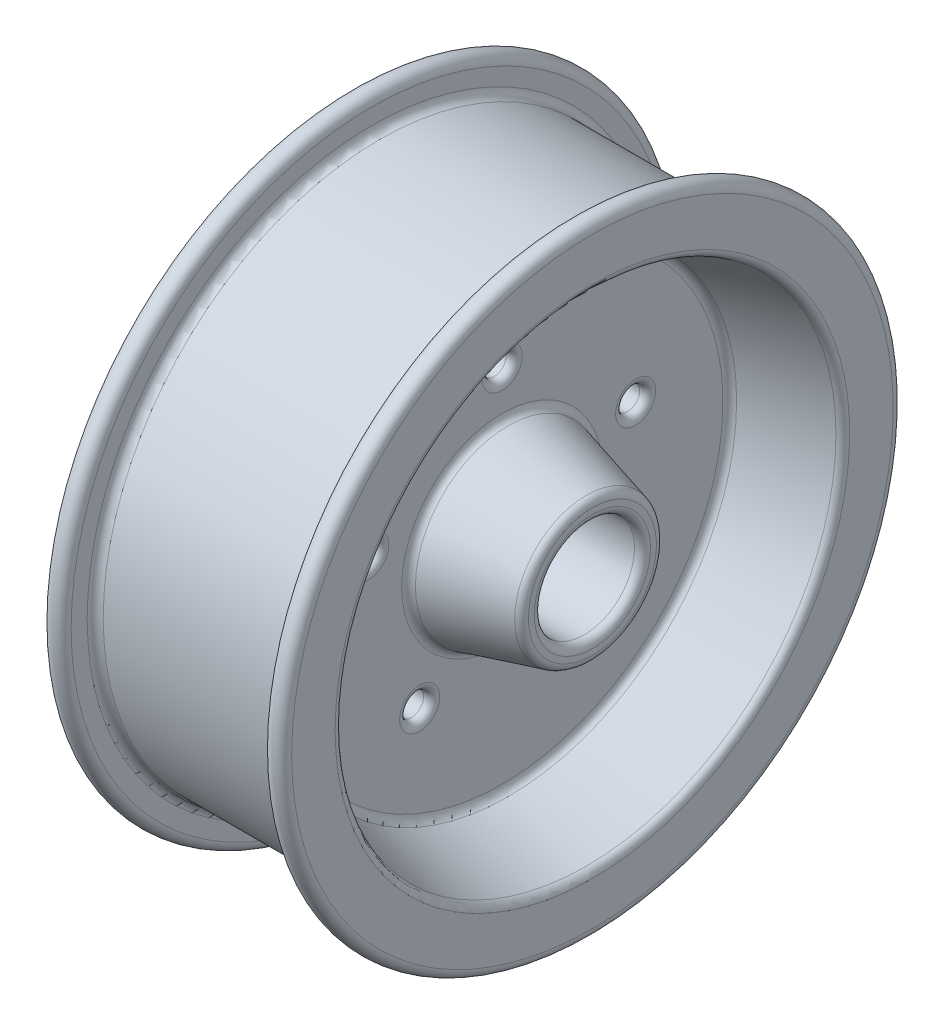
ISO-10303-21;
HEADER;
FILE_DESCRIPTION(('STEP AP214'),'2;1');
FILE_NAME('part.step','',(''),(''),'','','');
FILE_SCHEMA(('AUTOMOTIVE_DESIGN { 1 0 10303 214 1 1 1 1 }'));
ENDSEC;
DATA;
#1=APPLICATION_CONTEXT('core data for automotive mechanical design processes');
#2=APPLICATION_PROTOCOL_DEFINITION('international standard','automotive_design',2000,#1);
#3=PRODUCT_CONTEXT('',#1,'mechanical');
#4=PRODUCT('Part','Part','',(#3));
#5=PRODUCT_RELATED_PRODUCT_CATEGORY('part','',(#4));
#6=PRODUCT_DEFINITION_FORMATION('','',#4);
#7=PRODUCT_DEFINITION_CONTEXT('part definition',#1,'design');
#8=PRODUCT_DEFINITION('design','',#6,#7);
#9=PRODUCT_DEFINITION_SHAPE('','',#8);
#10=(LENGTH_UNIT() NAMED_UNIT(*) SI_UNIT(.MILLI.,.METRE.));
#11=(NAMED_UNIT(*) PLANE_ANGLE_UNIT() SI_UNIT($,.RADIAN.));
#12=(NAMED_UNIT(*) SI_UNIT($,.STERADIAN.) SOLID_ANGLE_UNIT());
#13=UNCERTAINTY_MEASURE_WITH_UNIT(LENGTH_MEASURE(1.E-05),#10,'distance_accuracy_value','');
#14=(GEOMETRIC_REPRESENTATION_CONTEXT(3) GLOBAL_UNCERTAINTY_ASSIGNED_CONTEXT((#13)) GLOBAL_UNIT_ASSIGNED_CONTEXT((#10,
#11,#12)) REPRESENTATION_CONTEXT('',''));
#15=CARTESIAN_POINT('',(0.,0.,0.));
#16=DIRECTION('',(0.,0.,1.));
#17=DIRECTION('',(1.,0.,0.));
#18=AXIS2_PLACEMENT_3D('',#15,#16,#17);
#19=CARTESIAN_POINT('',(-9.525,0.,0.));
#20=DIRECTION('',(1.,0.,0.));
#21=DIRECTION('',(0.,0.,-1.));
#22=AXIS2_PLACEMENT_3D('',#19,#20,#21);
#23=CONICAL_SURFACE('',#22,29.8816481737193,0.26179938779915);
#24=CARTESIAN_POINT('',(-11.4075996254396,0.,0.));
#25=DIRECTION('',(1.,0.,0.));
#26=DIRECTION('',(0.,0.,-1.));
#27=AXIS2_PLACEMENT_3D('',#24,#25,#26);
#28=CIRCLE('',#27,29.3772071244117);
#29=CARTESIAN_POINT('',(-11.4075996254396,0.,-29.3772071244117));
#30=VERTEX_POINT('',#29);
#31=EDGE_CURVE('E91',#30,#30,#28,.F.);
#32=ORIENTED_EDGE('',*,*,#31,.T.);
#33=EDGE_LOOP('',(#32));
#34=FACE_BOUND('',#33,.T.);
#35=CARTESIAN_POINT('',(-36.2174003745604,0.,0.));
#36=DIRECTION('',(-1.,0.,0.));
#37=DIRECTION('',(0.,0.,1.));
#38=AXIS2_PLACEMENT_3D('',#35,#36,#37);
#39=CIRCLE('',#38,22.7294410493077);
#40=CARTESIAN_POINT('',(-36.2174003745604,0.,22.7294410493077));
#41=VERTEX_POINT('',#40);
#42=EDGE_CURVE('E94',#41,#41,#39,.F.);
#43=ORIENTED_EDGE('',*,*,#42,.T.);
#44=EDGE_LOOP('',(#43));
#45=FACE_BOUND('',#44,.T.);
#46=ADVANCED_FACE('F29',(#34,#45),#23,.T.);
#47=CARTESIAN_POINT('',(-38.1,15.875,0.));
#48=DIRECTION('',(1.,0.,0.));
#49=DIRECTION('',(0.,0.,-1.));
#50=AXIS2_PLACEMENT_3D('',#47,#48,#49);
#51=PLANE('',#50);
#52=CARTESIAN_POINT('',(-38.1,0.,0.));
#53=DIRECTION('',(1.,0.,0.));
#54=DIRECTION('',(0.,0.,-1.));
#55=AXIS2_PLACEMENT_3D('',#52,#53,#54);
#56=CIRCLE('',#55,18.415);
#57=CARTESIAN_POINT('',(-38.1,0.,-18.415));
#58=VERTEX_POINT('',#57);
#59=EDGE_CURVE('E10',#58,#58,#56,.T.);
#60=ORIENTED_EDGE('',*,*,#59,.T.);
#61=EDGE_LOOP('',(#60));
#62=FACE_BOUND('',#61,.T.);
#63=CARTESIAN_POINT('',(-38.1,0.,0.));
#64=DIRECTION('',(1.,0.,0.));
#65=DIRECTION('',(0.,0.,-1.));
#66=AXIS2_PLACEMENT_3D('',#63,#64,#65);
#67=CIRCLE('',#66,20.2759894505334);
#68=CARTESIAN_POINT('',(-38.1,0.,-20.2759894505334));
#69=VERTEX_POINT('',#68);
#70=EDGE_CURVE('E36',#69,#69,#67,.F.);
#71=ORIENTED_EDGE('',*,*,#70,.T.);
#72=EDGE_LOOP('',(#71));
#73=FACE_BOUND('',#72,.T.);
#74=ADVANCED_FACE('F202',(#62,#73),#51,.F.);
#75=CARTESIAN_POINT('',(0.,0.,0.));
#76=DIRECTION('',(-1.,0.,0.));
#77=DIRECTION('',(0.,0.,1.));
#78=AXIS2_PLACEMENT_3D('',#75,#76,#77);
#79=CYLINDRICAL_SURFACE('',#78,15.875);
#80=CARTESIAN_POINT('',(35.56,0.,0.));
#81=DIRECTION('',(-1.,0.,0.));
#82=DIRECTION('',(0.,0.,1.));
#83=AXIS2_PLACEMENT_3D('',#80,#81,#82);
#84=CIRCLE('',#83,15.875);
#85=CARTESIAN_POINT('',(35.56,0.,15.875));
#86=VERTEX_POINT('',#85);
#87=EDGE_CURVE('E40',#86,#86,#84,.F.);
#88=ORIENTED_EDGE('',*,*,#87,.T.);
#89=EDGE_LOOP('',(#88));
#90=FACE_BOUND('',#89,.T.);
#91=CARTESIAN_POINT('',(-35.56,0.,0.));
#92=DIRECTION('',(1.,0.,0.));
#93=DIRECTION('',(0.,0.,-1.));
#94=AXIS2_PLACEMENT_3D('',#91,#92,#93);
#95=CIRCLE('',#94,15.875);
#96=CARTESIAN_POINT('',(-35.56,0.,-15.875));
#97=VERTEX_POINT('',#96);
#98=EDGE_CURVE('E44',#97,#97,#95,.F.);
#99=ORIENTED_EDGE('',*,*,#98,.T.);
#100=EDGE_LOOP('',(#99));
#101=FACE_BOUND('',#100,.T.);
#102=ADVANCED_FACE('F208',(#90,#101),#79,.F.);
#103=CARTESIAN_POINT('',(38.1,15.875,0.));
#104=DIRECTION('',(-1.,0.,0.));
#105=DIRECTION('',(0.,0.,1.));
#106=AXIS2_PLACEMENT_3D('',#103,#104,#105);
#107=PLANE('',#106);
#108=CARTESIAN_POINT('',(38.1,0.,0.));
#109=DIRECTION('',(-1.,0.,0.));
#110=DIRECTION('',(0.,0.,1.));
#111=AXIS2_PLACEMENT_3D('',#108,#109,#110);
#112=CIRCLE('',#111,20.2759894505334);
#113=CARTESIAN_POINT('',(38.1,0.,20.2759894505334));
#114=VERTEX_POINT('',#113);
#115=EDGE_CURVE('E49',#114,#114,#112,.F.);
#116=ORIENTED_EDGE('',*,*,#115,.T.);
#117=EDGE_LOOP('',(#116));
#118=FACE_BOUND('',#117,.T.);
#119=CARTESIAN_POINT('',(38.1,0.,0.));
#120=DIRECTION('',(-1.,0.,0.));
#121=DIRECTION('',(0.,0.,1.));
#122=AXIS2_PLACEMENT_3D('',#119,#120,#121);
#123=CIRCLE('',#122,18.415);
#124=CARTESIAN_POINT('',(38.1,0.,18.415));
#125=VERTEX_POINT('',#124);
#126=EDGE_CURVE('E52',#125,#125,#123,.T.);
#127=ORIENTED_EDGE('',*,*,#126,.T.);
#128=EDGE_LOOP('',(#127));
#129=FACE_BOUND('',#128,.T.);
#130=ADVANCED_FACE('F304',(#118,#129),#107,.F.);
#131=CARTESIAN_POINT('',(38.1,0.,0.));
#132=DIRECTION('',(-1.,0.,0.));
#133=DIRECTION('',(0.,0.,1.));
#134=AXIS2_PLACEMENT_3D('',#131,#132,#133);
#135=CONICAL_SURFACE('',#134,22.225,0.26179938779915);
#136=CARTESIAN_POINT('',(11.4075996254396,0.,0.));
#137=DIRECTION('',(-1.,0.,0.));
#138=DIRECTION('',(0.,0.,1.));
#139=AXIS2_PLACEMENT_3D('',#136,#137,#138);
#140=CIRCLE('',#139,29.3772071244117);
#141=CARTESIAN_POINT('',(11.4075996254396,0.,29.3772071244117));
#142=VERTEX_POINT('',#141);
#143=EDGE_CURVE('E55',#142,#142,#140,.F.);
#144=ORIENTED_EDGE('',*,*,#143,.T.);
#145=EDGE_LOOP('',(#144));
#146=FACE_BOUND('',#145,.T.);
#147=CARTESIAN_POINT('',(36.2174003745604,0.,0.));
#148=DIRECTION('',(1.,0.,0.));
#149=DIRECTION('',(0.,0.,-1.));
#150=AXIS2_PLACEMENT_3D('',#147,#148,#149);
#151=CIRCLE('',#150,22.7294410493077);
#152=CARTESIAN_POINT('',(36.2174003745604,0.,-22.7294410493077));
#153=VERTEX_POINT('',#152);
#154=EDGE_CURVE('E58',#153,#153,#151,.F.);
#155=ORIENTED_EDGE('',*,*,#154,.T.);
#156=EDGE_LOOP('',(#155));
#157=FACE_BOUND('',#156,.T.);
#158=ADVANCED_FACE('F309',(#146,#157),#135,.T.);
#159=CARTESIAN_POINT('',(9.525,29.8816481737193,0.));
#160=DIRECTION('',(-1.,0.,0.));
#161=DIRECTION('',(0.,0.,1.));
#162=AXIS2_PLACEMENT_3D('',#159,#160,#161);
#163=PLANE('',#162);
#164=CARTESIAN_POINT('',(9.525,13.7358053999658,42.2744621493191));
#165=DIRECTION('',(-1.,0.,0.));
#166=DIRECTION('',(0.,0.,1.));
#167=AXIS2_PLACEMENT_3D('',#164,#165,#166);
#168=CIRCLE('',#167,6.35000000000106);
#169=CARTESIAN_POINT('',(9.525,13.7358053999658,48.6244621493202));
#170=VERTEX_POINT('',#169);
#171=EDGE_CURVE('E142',#170,#170,#168,.T.);
#172=ORIENTED_EDGE('',*,*,#171,.T.);
#173=EDGE_LOOP('',(#172));
#174=FACE_BOUND('',#173,.T.);
#175=CARTESIAN_POINT('',(9.525,-35.9608053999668,26.1270544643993));
#176=DIRECTION('',(-1.,0.,0.));
#177=DIRECTION('',(0.,0.,1.));
#178=AXIS2_PLACEMENT_3D('',#175,#176,#177);
#179=CIRCLE('',#178,6.35000000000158);
#180=CARTESIAN_POINT('',(9.525,-35.9608053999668,32.4770544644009));
#181=VERTEX_POINT('',#180);
#182=EDGE_CURVE('E145',#181,#181,#179,.T.);
#183=ORIENTED_EDGE('',*,*,#182,.T.);
#184=EDGE_LOOP('',(#183));
#185=FACE_BOUND('',#184,.T.);
#186=CARTESIAN_POINT('',(9.525,-35.960805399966,-26.1270544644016));
#187=DIRECTION('',(-1.,0.,0.));
#188=DIRECTION('',(0.,0.,1.));
#189=AXIS2_PLACEMENT_3D('',#186,#187,#188);
#190=CIRCLE('',#189,6.35000000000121);
#191=CARTESIAN_POINT('',(9.525,-35.960805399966,-19.7770544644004));
#192=VERTEX_POINT('',#191);
#193=EDGE_CURVE('E148',#192,#192,#190,.T.);
#194=ORIENTED_EDGE('',*,*,#193,.T.);
#195=EDGE_LOOP('',(#194));
#196=FACE_BOUND('',#195,.T.);
#197=CARTESIAN_POINT('',(9.525,13.7358053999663,-42.2744621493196));
#198=DIRECTION('',(-1.,0.,0.));
#199=DIRECTION('',(0.,0.,1.));
#200=AXIS2_PLACEMENT_3D('',#197,#198,#199);
#201=CIRCLE('',#200,6.35);
#202=CARTESIAN_POINT('',(9.525,13.7358053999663,-35.9244621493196));
#203=VERTEX_POINT('',#202);
#204=EDGE_CURVE('E151',#203,#203,#201,.T.);
#205=ORIENTED_EDGE('',*,*,#204,.T.);
#206=EDGE_LOOP('',(#205));
#207=FACE_BOUND('',#206,.T.);
#208=CARTESIAN_POINT('',(9.525,44.45,0.));
#209=DIRECTION('',(-1.,0.,0.));
#210=DIRECTION('',(0.,0.,1.));
#211=AXIS2_PLACEMENT_3D('',#208,#209,#210);
#212=CIRCLE('',#211,6.35);
#213=CARTESIAN_POINT('',(9.525,44.45,6.35));
#214=VERTEX_POINT('',#213);
#215=EDGE_CURVE('E154',#214,#214,#212,.T.);
#216=ORIENTED_EDGE('',*,*,#215,.T.);
#217=EDGE_LOOP('',(#216));
#218=FACE_BOUND('',#217,.T.);
#219=CARTESIAN_POINT('',(9.525,0.,0.));
#220=DIRECTION('',(-1.,0.,0.));
#221=DIRECTION('',(0.,0.,1.));
#222=AXIS2_PLACEMENT_3D('',#219,#220,#221);
#223=CIRCLE('',#222,69.9217412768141);
#224=CARTESIAN_POINT('',(9.525,0.,69.9217412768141));
#225=VERTEX_POINT('',#224);
#226=EDGE_CURVE('E157',#225,#225,#223,.F.);
#227=ORIENTED_EDGE('',*,*,#226,.T.);
#228=EDGE_LOOP('',(#227));
#229=FACE_BOUND('',#228,.T.);
#230=CARTESIAN_POINT('',(9.525,0.,0.));
#231=DIRECTION('',(-1.,0.,0.));
#232=DIRECTION('',(0.,0.,1.));
#233=AXIS2_PLACEMENT_3D('',#230,#231,#232);
#234=CIRCLE('',#233,31.8306587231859);
#235=CARTESIAN_POINT('',(9.525,0.,31.8306587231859));
#236=VERTEX_POINT('',#235);
#237=EDGE_CURVE('E160',#236,#236,#234,.T.);
#238=ORIENTED_EDGE('',*,*,#237,.T.);
#239=EDGE_LOOP('',(#238));
#240=FACE_BOUND('',#239,.T.);
#241=ADVANCED_FACE('F315',(#174,#185,#196,#207,#218,#229,#240),#163,.F.);
#242=CARTESIAN_POINT('',(9.525,0.,0.));
#243=DIRECTION('',(1.,0.,0.));
#244=DIRECTION('',(0.,0.,-1.));
#245=AXIS2_PLACEMENT_3D('',#242,#243,#244);
#246=CONICAL_SURFACE('',#245,71.8707518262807,0.26179938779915);
#247=CARTESIAN_POINT('',(36.2174003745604,0.,0.));
#248=DIRECTION('',(-1.,0.,0.));
#249=DIRECTION('',(0.,0.,1.));
#250=AXIS2_PLACEMENT_3D('',#247,#248,#249);
#251=CIRCLE('',#250,79.0229589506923);
#252=CARTESIAN_POINT('',(36.2174003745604,0.,79.0229589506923));
#253=VERTEX_POINT('',#252);
#254=EDGE_CURVE('E61',#253,#253,#251,.F.);
#255=ORIENTED_EDGE('',*,*,#254,.T.);
#256=EDGE_LOOP('',(#255));
#257=FACE_BOUND('',#256,.T.);
#258=CARTESIAN_POINT('',(11.4075996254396,0.,0.));
#259=DIRECTION('',(1.,0.,0.));
#260=DIRECTION('',(0.,0.,-1.));
#261=AXIS2_PLACEMENT_3D('',#258,#259,#260);
#262=CIRCLE('',#261,72.3751928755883);
#263=CARTESIAN_POINT('',(11.4075996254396,0.,-72.3751928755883));
#264=VERTEX_POINT('',#263);
#265=EDGE_CURVE('E64',#264,#264,#262,.F.);
#266=ORIENTED_EDGE('',*,*,#265,.T.);
#267=EDGE_LOOP('',(#266));
#268=FACE_BOUND('',#267,.T.);
#269=ADVANCED_FACE('F319',(#257,#268),#246,.F.);
#270=CARTESIAN_POINT('',(38.1,79.5274,0.));
#271=DIRECTION('',(-1.,0.,0.));
#272=DIRECTION('',(0.,0.,1.));
#273=AXIS2_PLACEMENT_3D('',#270,#271,#272);
#274=PLANE('',#273);
#275=CARTESIAN_POINT('',(38.1,0.,0.));
#276=DIRECTION('',(-1.,0.,0.));
#277=DIRECTION('',(0.,0.,1.));
#278=AXIS2_PLACEMENT_3D('',#275,#276,#277);
#279=CIRCLE('',#278,81.4764105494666);
#280=CARTESIAN_POINT('',(38.1,0.,81.4764105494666));
#281=VERTEX_POINT('',#280);
#282=EDGE_CURVE('E67',#281,#281,#279,.T.);
#283=ORIENTED_EDGE('',*,*,#282,.T.);
#284=EDGE_LOOP('',(#283));
#285=FACE_BOUND('',#284,.T.);
#286=CARTESIAN_POINT('',(38.1,0.,0.));
#287=DIRECTION('',(-1.,0.,0.));
#288=DIRECTION('',(0.,0.,1.));
#289=AXIS2_PLACEMENT_3D('',#286,#287,#288);
#290=CIRCLE('',#289,95.25);
#291=CARTESIAN_POINT('',(38.1,0.,95.25));
#292=VERTEX_POINT('',#291);
#293=EDGE_CURVE('E169',#292,#292,#290,.T.);
#294=ORIENTED_EDGE('',*,*,#293,.F.);
#295=EDGE_LOOP('',(#294));
#296=FACE_BOUND('',#295,.T.);
#297=ADVANCED_FACE('F323',(#285,#296),#274,.F.);
#298=CARTESIAN_POINT('',(34.925,0.,0.));
#299=DIRECTION('',(-1.,0.,0.));
#300=DIRECTION('',(0.,0.,1.));
#301=AXIS2_PLACEMENT_3D('',#298,#299,#300);
#302=TOROIDAL_SURFACE('',#301,95.25,3.175);
#303=CARTESIAN_POINT('',(31.75,0.,0.));
#304=DIRECTION('',(-1.,0.,0.));
#305=DIRECTION('',(0.,0.,1.));
#306=AXIS2_PLACEMENT_3D('',#303,#304,#305);
#307=CIRCLE('',#306,95.25);
#308=CARTESIAN_POINT('',(31.75,0.,95.25));
#309=VERTEX_POINT('',#308);
#310=EDGE_CURVE('E172',#309,#309,#307,.T.);
#311=ORIENTED_EDGE('',*,*,#310,.F.);
#312=EDGE_LOOP('',(#311));
#313=FACE_BOUND('',#312,.T.);
#314=ORIENTED_EDGE('',*,*,#293,.T.);
#315=EDGE_LOOP('',(#314));
#316=FACE_BOUND('',#315,.T.);
#317=ADVANCED_FACE('F327',(#313,#316),#302,.T.);
#318=CARTESIAN_POINT('',(31.75,95.25,0.));
#319=DIRECTION('',(1.,0.,0.));
#320=DIRECTION('',(0.,0.,-1.));
#321=AXIS2_PLACEMENT_3D('',#318,#319,#320);
#322=PLANE('',#321);
#323=CARTESIAN_POINT('',(31.75,0.,0.));
#324=DIRECTION('',(1.,0.,0.));
#325=DIRECTION('',(0.,0.,-1.));
#326=AXIS2_PLACEMENT_3D('',#323,#324,#325);
#327=CIRCLE('',#326,90.17);
#328=CARTESIAN_POINT('',(31.75,0.,-90.17));
#329=VERTEX_POINT('',#328);
#330=EDGE_CURVE('E70',#329,#329,#327,.T.);
#331=ORIENTED_EDGE('',*,*,#330,.T.);
#332=EDGE_LOOP('',(#331));
#333=FACE_BOUND('',#332,.T.);
#334=ORIENTED_EDGE('',*,*,#310,.T.);
#335=EDGE_LOOP('',(#334));
#336=FACE_BOUND('',#335,.T.);
#337=ADVANCED_FACE('F198',(#333,#336),#322,.F.);
#338=CARTESIAN_POINT('',(0.,0.,0.));
#339=DIRECTION('',(-1.,0.,0.));
#340=DIRECTION('',(0.,0.,1.));
#341=AXIS2_PLACEMENT_3D('',#338,#339,#340);
#342=CYLINDRICAL_SURFACE('',#341,87.63);
#343=CARTESIAN_POINT('',(-29.21,0.,0.));
#344=DIRECTION('',(-1.,0.,0.));
#345=DIRECTION('',(0.,0.,1.));
#346=AXIS2_PLACEMENT_3D('',#343,#344,#345);
#347=CIRCLE('',#346,87.63);
#348=CARTESIAN_POINT('',(-29.21,0.,87.63));
#349=VERTEX_POINT('',#348);
#350=EDGE_CURVE('E73',#349,#349,#347,.F.);
#351=ORIENTED_EDGE('',*,*,#350,.T.);
#352=EDGE_LOOP('',(#351));
#353=FACE_BOUND('',#352,.T.);
#354=CARTESIAN_POINT('',(29.21,0.,0.));
#355=DIRECTION('',(1.,0.,0.));
#356=DIRECTION('',(0.,0.,-1.));
#357=AXIS2_PLACEMENT_3D('',#354,#355,#356);
#358=CIRCLE('',#357,87.63);
#359=CARTESIAN_POINT('',(29.21,0.,-87.63));
#360=VERTEX_POINT('',#359);
#361=EDGE_CURVE('E76',#360,#360,#358,.F.);
#362=ORIENTED_EDGE('',*,*,#361,.T.);
#363=EDGE_LOOP('',(#362));
#364=FACE_BOUND('',#363,.T.);
#365=ADVANCED_FACE('F192',(#353,#364),#342,.T.);
#366=CARTESIAN_POINT('',(-31.75,95.25,0.));
#367=DIRECTION('',(-1.,0.,0.));
#368=DIRECTION('',(0.,0.,1.));
#369=AXIS2_PLACEMENT_3D('',#366,#367,#368);
#370=PLANE('',#369);
#371=CARTESIAN_POINT('',(-31.75,0.,0.));
#372=DIRECTION('',(-1.,0.,0.));
#373=DIRECTION('',(0.,0.,1.));
#374=AXIS2_PLACEMENT_3D('',#371,#372,#373);
#375=CIRCLE('',#374,90.17);
#376=CARTESIAN_POINT('',(-31.75,0.,90.17));
#377=VERTEX_POINT('',#376);
#378=EDGE_CURVE('E79',#377,#377,#375,.T.);
#379=ORIENTED_EDGE('',*,*,#378,.T.);
#380=EDGE_LOOP('',(#379));
#381=FACE_BOUND('',#380,.T.);
#382=CARTESIAN_POINT('',(-31.75,0.,0.));
#383=DIRECTION('',(-1.,0.,0.));
#384=DIRECTION('',(0.,0.,1.));
#385=AXIS2_PLACEMENT_3D('',#382,#383,#384);
#386=CIRCLE('',#385,95.25);
#387=CARTESIAN_POINT('',(-31.75,0.,95.25));
#388=VERTEX_POINT('',#387);
#389=EDGE_CURVE('E175',#388,#388,#386,.T.);
#390=ORIENTED_EDGE('',*,*,#389,.F.);
#391=EDGE_LOOP('',(#390));
#392=FACE_BOUND('',#391,.T.);
#393=ADVANCED_FACE('F187',(#381,#392),#370,.F.);
#394=CARTESIAN_POINT('',(-34.925,0.,0.));
#395=DIRECTION('',(-1.,0.,0.));
#396=DIRECTION('',(0.,0.,1.));
#397=AXIS2_PLACEMENT_3D('',#394,#395,#396);
#398=TOROIDAL_SURFACE('',#397,95.25,3.175);
#399=CARTESIAN_POINT('',(-38.1,0.,0.));
#400=DIRECTION('',(-1.,0.,0.));
#401=DIRECTION('',(0.,0.,1.));
#402=AXIS2_PLACEMENT_3D('',#399,#400,#401);
#403=CIRCLE('',#402,95.25);
#404=CARTESIAN_POINT('',(-38.1,0.,95.25));
#405=VERTEX_POINT('',#404);
#406=EDGE_CURVE('E178',#405,#405,#403,.T.);
#407=ORIENTED_EDGE('',*,*,#406,.F.);
#408=EDGE_LOOP('',(#407));
#409=FACE_BOUND('',#408,.T.);
#410=ORIENTED_EDGE('',*,*,#389,.T.);
#411=EDGE_LOOP('',(#410));
#412=FACE_BOUND('',#411,.T.);
#413=ADVANCED_FACE('F184',(#409,#412),#398,.T.);
#414=CARTESIAN_POINT('',(-38.1,79.5274,0.));
#415=DIRECTION('',(1.,0.,0.));
#416=DIRECTION('',(0.,0.,-1.));
#417=AXIS2_PLACEMENT_3D('',#414,#415,#416);
#418=PLANE('',#417);
#419=CARTESIAN_POINT('',(-38.1,0.,0.));
#420=DIRECTION('',(1.,0.,0.));
#421=DIRECTION('',(0.,0.,-1.));
#422=AXIS2_PLACEMENT_3D('',#419,#420,#421);
#423=CIRCLE('',#422,81.4764105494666);
#424=CARTESIAN_POINT('',(-38.1,0.,-81.4764105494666));
#425=VERTEX_POINT('',#424);
#426=EDGE_CURVE('E82',#425,#425,#423,.T.);
#427=ORIENTED_EDGE('',*,*,#426,.T.);
#428=EDGE_LOOP('',(#427));
#429=FACE_BOUND('',#428,.T.);
#430=ORIENTED_EDGE('',*,*,#406,.T.);
#431=EDGE_LOOP('',(#430));
#432=FACE_BOUND('',#431,.T.);
#433=ADVANCED_FACE('F182',(#429,#432),#418,.F.);
#434=CARTESIAN_POINT('',(-38.1,0.,0.));
#435=DIRECTION('',(-1.,0.,0.));
#436=DIRECTION('',(0.,0.,1.));
#437=AXIS2_PLACEMENT_3D('',#434,#435,#436);
#438=CONICAL_SURFACE('',#437,79.5274,0.26179938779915);
#439=CARTESIAN_POINT('',(-11.4075996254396,0.,0.));
#440=DIRECTION('',(-1.,0.,0.));
#441=DIRECTION('',(0.,0.,1.));
#442=AXIS2_PLACEMENT_3D('',#439,#440,#441);
#443=CIRCLE('',#442,72.3751928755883);
#444=CARTESIAN_POINT('',(-11.4075996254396,0.,72.3751928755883));
#445=VERTEX_POINT('',#444);
#446=EDGE_CURVE('E85',#445,#445,#443,.F.);
#447=ORIENTED_EDGE('',*,*,#446,.T.);
#448=EDGE_LOOP('',(#447));
#449=FACE_BOUND('',#448,.T.);
#450=CARTESIAN_POINT('',(-36.2174003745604,0.,0.));
#451=DIRECTION('',(1.,0.,0.));
#452=DIRECTION('',(0.,0.,-1.));
#453=AXIS2_PLACEMENT_3D('',#450,#451,#452);
#454=CIRCLE('',#453,79.0229589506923);
#455=CARTESIAN_POINT('',(-36.2174003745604,0.,-79.0229589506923));
#456=VERTEX_POINT('',#455);
#457=EDGE_CURVE('E88',#456,#456,#454,.F.);
#458=ORIENTED_EDGE('',*,*,#457,.T.);
#459=EDGE_LOOP('',(#458));
#460=FACE_BOUND('',#459,.T.);
#461=ADVANCED_FACE('F366',(#449,#460),#438,.F.);
#462=CARTESIAN_POINT('',(-9.525,29.8816481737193,0.));
#463=DIRECTION('',(1.,0.,0.));
#464=DIRECTION('',(0.,0.,-1.));
#465=AXIS2_PLACEMENT_3D('',#462,#463,#464);
#466=PLANE('',#465);
#467=CARTESIAN_POINT('',(-9.525,13.7358053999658,42.2744621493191));
#468=DIRECTION('',(1.,0.,0.));
#469=DIRECTION('',(0.,0.,-1.));
#470=AXIS2_PLACEMENT_3D('',#467,#468,#469);
#471=CIRCLE('',#470,6.35000000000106);
#472=CARTESIAN_POINT('',(-9.525,13.7358053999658,35.9244621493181));
#473=VERTEX_POINT('',#472);
#474=EDGE_CURVE('E121',#473,#473,#471,.T.);
#475=ORIENTED_EDGE('',*,*,#474,.T.);
#476=EDGE_LOOP('',(#475));
#477=FACE_BOUND('',#476,.T.);
#478=CARTESIAN_POINT('',(-9.525,-35.9608053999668,26.1270544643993));
#479=DIRECTION('',(1.,0.,0.));
#480=DIRECTION('',(0.,0.,-1.));
#481=AXIS2_PLACEMENT_3D('',#478,#479,#480);
#482=CIRCLE('',#481,6.35000000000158);
#483=CARTESIAN_POINT('',(-9.525,-35.9608053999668,19.7770544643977));
#484=VERTEX_POINT('',#483);
#485=EDGE_CURVE('E124',#484,#484,#482,.T.);
#486=ORIENTED_EDGE('',*,*,#485,.T.);
#487=EDGE_LOOP('',(#486));
#488=FACE_BOUND('',#487,.T.);
#489=CARTESIAN_POINT('',(-9.525,-35.960805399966,-26.1270544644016));
#490=DIRECTION('',(1.,0.,0.));
#491=DIRECTION('',(0.,0.,-1.));
#492=AXIS2_PLACEMENT_3D('',#489,#490,#491);
#493=CIRCLE('',#492,6.35000000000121);
#494=CARTESIAN_POINT('',(-9.525,-35.960805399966,-32.4770544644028));
#495=VERTEX_POINT('',#494);
#496=EDGE_CURVE('E127',#495,#495,#493,.T.);
#497=ORIENTED_EDGE('',*,*,#496,.T.);
#498=EDGE_LOOP('',(#497));
#499=FACE_BOUND('',#498,.T.);
#500=CARTESIAN_POINT('',(-9.525,13.7358053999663,-42.2744621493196));
#501=DIRECTION('',(1.,0.,0.));
#502=DIRECTION('',(0.,0.,-1.));
#503=AXIS2_PLACEMENT_3D('',#500,#501,#502);
#504=CIRCLE('',#503,6.35);
#505=CARTESIAN_POINT('',(-9.525,13.7358053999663,-48.6244621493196));
#506=VERTEX_POINT('',#505);
#507=EDGE_CURVE('E130',#506,#506,#504,.T.);
#508=ORIENTED_EDGE('',*,*,#507,.T.);
#509=EDGE_LOOP('',(#508));
#510=FACE_BOUND('',#509,.T.);
#511=CARTESIAN_POINT('',(-9.525,44.45,0.));
#512=DIRECTION('',(1.,0.,0.));
#513=DIRECTION('',(0.,0.,-1.));
#514=AXIS2_PLACEMENT_3D('',#511,#512,#513);
#515=CIRCLE('',#514,6.35);
#516=CARTESIAN_POINT('',(-9.525,44.45,-6.35));
#517=VERTEX_POINT('',#516);
#518=EDGE_CURVE('E133',#517,#517,#515,.T.);
#519=ORIENTED_EDGE('',*,*,#518,.T.);
#520=EDGE_LOOP('',(#519));
#521=FACE_BOUND('',#520,.T.);
#522=CARTESIAN_POINT('',(-9.525,0.,0.));
#523=DIRECTION('',(1.,0.,0.));
#524=DIRECTION('',(0.,0.,-1.));
#525=AXIS2_PLACEMENT_3D('',#522,#523,#524);
#526=CIRCLE('',#525,31.8306587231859);
#527=CARTESIAN_POINT('',(-9.525,0.,-31.8306587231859));
#528=VERTEX_POINT('',#527);
#529=EDGE_CURVE('E136',#528,#528,#526,.T.);
#530=ORIENTED_EDGE('',*,*,#529,.T.);
#531=EDGE_LOOP('',(#530));
#532=FACE_BOUND('',#531,.T.);
#533=CARTESIAN_POINT('',(-9.525,0.,0.));
#534=DIRECTION('',(1.,0.,0.));
#535=DIRECTION('',(0.,0.,-1.));
#536=AXIS2_PLACEMENT_3D('',#533,#534,#535);
#537=CIRCLE('',#536,69.9217412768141);
#538=CARTESIAN_POINT('',(-9.525,0.,-69.9217412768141));
#539=VERTEX_POINT('',#538);
#540=EDGE_CURVE('E139',#539,#539,#537,.F.);
#541=ORIENTED_EDGE('',*,*,#540,.T.);
#542=EDGE_LOOP('',(#541));
#543=FACE_BOUND('',#542,.T.);
#544=ADVANCED_FACE('F376',(#477,#488,#499,#510,#521,#532,#543),#466,.F.);
#545=CARTESIAN_POINT('',(-38.1,44.45,0.));
#546=DIRECTION('',(1.,0.,0.));
#547=DIRECTION('',(0.,0.,-1.));
#548=AXIS2_PLACEMENT_3D('',#545,#546,#547);
#549=CYLINDRICAL_SURFACE('',#548,3.81);
#550=CARTESIAN_POINT('',(6.985,44.45,0.));
#551=DIRECTION('',(-1.,0.,0.));
#552=DIRECTION('',(0.,0.,1.));
#553=AXIS2_PLACEMENT_3D('',#550,#551,#552);
#554=CIRCLE('',#553,3.81);
#555=CARTESIAN_POINT('',(6.985,44.45,3.81));
#556=VERTEX_POINT('',#555);
#557=EDGE_CURVE('E97',#556,#556,#554,.F.);
#558=ORIENTED_EDGE('',*,*,#557,.T.);
#559=EDGE_LOOP('',(#558));
#560=FACE_BOUND('',#559,.T.);
#561=CARTESIAN_POINT('',(-6.985,44.45,0.));
#562=DIRECTION('',(1.,0.,0.));
#563=DIRECTION('',(0.,0.,-1.));
#564=AXIS2_PLACEMENT_3D('',#561,#562,#563);
#565=CIRCLE('',#564,3.81);
#566=CARTESIAN_POINT('',(-6.985,44.45,-3.81));
#567=VERTEX_POINT('',#566);
#568=EDGE_CURVE('E100',#567,#567,#565,.F.);
#569=ORIENTED_EDGE('',*,*,#568,.T.);
#570=EDGE_LOOP('',(#569));
#571=FACE_BOUND('',#570,.T.);
#572=ADVANCED_FACE('F386',(#560,#571),#549,.F.);
#573=CARTESIAN_POINT('',(-38.1,13.7358053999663,-42.2744621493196));
#574=DIRECTION('',(1.,0.,0.));
#575=DIRECTION('',(0.,0.,-1.));
#576=AXIS2_PLACEMENT_3D('',#573,#574,#575);
#577=CYLINDRICAL_SURFACE('',#576,3.81);
#578=CARTESIAN_POINT('',(6.985,13.7358053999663,-42.2744621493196));
#579=DIRECTION('',(-1.,0.,0.));
#580=DIRECTION('',(0.,0.,1.));
#581=AXIS2_PLACEMENT_3D('',#578,#579,#580);
#582=CIRCLE('',#581,3.81);
#583=CARTESIAN_POINT('',(6.985,13.7358053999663,-38.4644621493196));
#584=VERTEX_POINT('',#583);
#585=EDGE_CURVE('E103',#584,#584,#582,.F.);
#586=ORIENTED_EDGE('',*,*,#585,.T.);
#587=EDGE_LOOP('',(#586));
#588=FACE_BOUND('',#587,.T.);
#589=CARTESIAN_POINT('',(-6.985,13.7358053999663,-42.2744621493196));
#590=DIRECTION('',(1.,0.,0.));
#591=DIRECTION('',(0.,0.,-1.));
#592=AXIS2_PLACEMENT_3D('',#589,#590,#591);
#593=CIRCLE('',#592,3.81);
#594=CARTESIAN_POINT('',(-6.985,13.7358053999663,-46.0844621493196));
#595=VERTEX_POINT('',#594);
#596=EDGE_CURVE('E106',#595,#595,#593,.F.);
#597=ORIENTED_EDGE('',*,*,#596,.T.);
#598=EDGE_LOOP('',(#597));
#599=FACE_BOUND('',#598,.T.);
#600=ADVANCED_FACE('F396',(#588,#599),#577,.F.);
#601=CARTESIAN_POINT('',(-38.1,-35.960805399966,-26.1270544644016));
#602=DIRECTION('',(1.,0.,0.));
#603=DIRECTION('',(0.,0.,-1.));
#604=AXIS2_PLACEMENT_3D('',#601,#602,#603);
#605=CYLINDRICAL_SURFACE('',#604,3.81000000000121);
#606=CARTESIAN_POINT('',(6.985,-35.960805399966,-26.1270544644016));
#607=DIRECTION('',(-1.,0.,0.));
#608=DIRECTION('',(0.,0.,1.));
#609=AXIS2_PLACEMENT_3D('',#606,#607,#608);
#610=CIRCLE('',#609,3.81000000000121);
#611=CARTESIAN_POINT('',(6.985,-35.960805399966,-22.3170544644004));
#612=VERTEX_POINT('',#611);
#613=EDGE_CURVE('E109',#612,#612,#610,.F.);
#614=ORIENTED_EDGE('',*,*,#613,.T.);
#615=EDGE_LOOP('',(#614));
#616=FACE_BOUND('',#615,.T.);
#617=CARTESIAN_POINT('',(-6.985,-35.960805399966,-26.1270544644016));
#618=DIRECTION('',(1.,0.,0.));
#619=DIRECTION('',(0.,0.,-1.));
#620=AXIS2_PLACEMENT_3D('',#617,#618,#619);
#621=CIRCLE('',#620,3.81000000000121);
#622=CARTESIAN_POINT('',(-6.985,-35.960805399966,-29.9370544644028));
#623=VERTEX_POINT('',#622);
#624=EDGE_CURVE('E112',#623,#623,#621,.F.);
#625=ORIENTED_EDGE('',*,*,#624,.T.);
#626=EDGE_LOOP('',(#625));
#627=FACE_BOUND('',#626,.T.);
#628=ADVANCED_FACE('F406',(#616,#627),#605,.F.);
#629=CARTESIAN_POINT('',(-38.1,-35.9608053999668,26.1270544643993));
#630=DIRECTION('',(1.,0.,0.));
#631=DIRECTION('',(0.,0.,-1.));
#632=AXIS2_PLACEMENT_3D('',#629,#630,#631);
#633=CYLINDRICAL_SURFACE('',#632,3.81000000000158);
#634=CARTESIAN_POINT('',(6.985,-35.9608053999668,26.1270544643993));
#635=DIRECTION('',(-1.,0.,0.));
#636=DIRECTION('',(0.,0.,1.));
#637=AXIS2_PLACEMENT_3D('',#634,#635,#636);
#638=CIRCLE('',#637,3.81000000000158);
#639=CARTESIAN_POINT('',(6.985,-35.9608053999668,29.9370544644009));
#640=VERTEX_POINT('',#639);
#641=EDGE_CURVE('E115',#640,#640,#638,.F.);
#642=ORIENTED_EDGE('',*,*,#641,.T.);
#643=EDGE_LOOP('',(#642));
#644=FACE_BOUND('',#643,.T.);
#645=CARTESIAN_POINT('',(-6.985,-35.9608053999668,26.1270544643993));
#646=DIRECTION('',(1.,0.,0.));
#647=DIRECTION('',(0.,0.,-1.));
#648=AXIS2_PLACEMENT_3D('',#645,#646,#647);
#649=CIRCLE('',#648,3.81000000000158);
#650=CARTESIAN_POINT('',(-6.985,-35.9608053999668,22.3170544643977));
#651=VERTEX_POINT('',#650);
#652=EDGE_CURVE('E118',#651,#651,#649,.F.);
#653=ORIENTED_EDGE('',*,*,#652,.T.);
#654=EDGE_LOOP('',(#653));
#655=FACE_BOUND('',#654,.T.);
#656=ADVANCED_FACE('F416',(#644,#655),#633,.F.);
#657=CARTESIAN_POINT('',(-38.1,13.7358053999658,42.2744621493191));
#658=DIRECTION('',(1.,0.,0.));
#659=DIRECTION('',(0.,0.,-1.));
#660=AXIS2_PLACEMENT_3D('',#657,#658,#659);
#661=CYLINDRICAL_SURFACE('',#660,3.81000000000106);
#662=CARTESIAN_POINT('',(6.985,13.7358053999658,42.2744621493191));
#663=DIRECTION('',(-1.,0.,0.));
#664=DIRECTION('',(0.,0.,1.));
#665=AXIS2_PLACEMENT_3D('',#662,#663,#664);
#666=CIRCLE('',#665,3.81000000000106);
#667=CARTESIAN_POINT('',(6.985,13.7358053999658,46.0844621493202));
#668=VERTEX_POINT('',#667);
#669=EDGE_CURVE('E163',#668,#668,#666,.F.);
#670=ORIENTED_EDGE('',*,*,#669,.T.);
#671=EDGE_LOOP('',(#670));
#672=FACE_BOUND('',#671,.T.);
#673=CARTESIAN_POINT('',(-6.985,13.7358053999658,42.2744621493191));
#674=DIRECTION('',(1.,0.,0.));
#675=DIRECTION('',(0.,0.,-1.));
#676=AXIS2_PLACEMENT_3D('',#673,#674,#675);
#677=CIRCLE('',#676,3.81000000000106);
#678=CARTESIAN_POINT('',(-6.985,13.7358053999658,38.4644621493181));
#679=VERTEX_POINT('',#678);
#680=EDGE_CURVE('E166',#679,#679,#677,.F.);
#681=ORIENTED_EDGE('',*,*,#680,.T.);
#682=EDGE_LOOP('',(#681));
#683=FACE_BOUND('',#682,.T.);
#684=ADVANCED_FACE('F217',(#672,#683),#661,.F.);
#685=CARTESIAN_POINT('',(6.985,13.7358053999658,42.2744621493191));
#686=DIRECTION('',(-1.,0.,0.));
#687=DIRECTION('',(0.,0.,1.));
#688=AXIS2_PLACEMENT_3D('',#685,#686,#687);
#689=TOROIDAL_SURFACE('',#688,6.35000000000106,2.54);
#690=ORIENTED_EDGE('',*,*,#171,.F.);
#691=EDGE_LOOP('',(#690));
#692=FACE_BOUND('',#691,.T.);
#693=ORIENTED_EDGE('',*,*,#669,.F.);
#694=EDGE_LOOP('',(#693));
#695=FACE_BOUND('',#694,.T.);
#696=ADVANCED_FACE('F213',(#692,#695),#689,.T.);
#697=CARTESIAN_POINT('',(-6.985,13.7358053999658,42.2744621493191));
#698=DIRECTION('',(1.,0.,0.));
#699=DIRECTION('',(0.,0.,-1.));
#700=AXIS2_PLACEMENT_3D('',#697,#698,#699);
#701=TOROIDAL_SURFACE('',#700,6.35000000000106,2.54);
#702=ORIENTED_EDGE('',*,*,#680,.F.);
#703=EDGE_LOOP('',(#702));
#704=FACE_BOUND('',#703,.T.);
#705=ORIENTED_EDGE('',*,*,#474,.F.);
#706=EDGE_LOOP('',(#705));
#707=FACE_BOUND('',#706,.T.);
#708=ADVANCED_FACE('F216',(#704,#707),#701,.T.);
#709=CARTESIAN_POINT('',(6.985,-35.9608053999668,26.1270544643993));
#710=DIRECTION('',(-1.,0.,0.));
#711=DIRECTION('',(0.,0.,1.));
#712=AXIS2_PLACEMENT_3D('',#709,#710,#711);
#713=TOROIDAL_SURFACE('',#712,6.35000000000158,2.54);
#714=ORIENTED_EDGE('',*,*,#182,.F.);
#715=EDGE_LOOP('',(#714));
#716=FACE_BOUND('',#715,.T.);
#717=ORIENTED_EDGE('',*,*,#641,.F.);
#718=EDGE_LOOP('',(#717));
#719=FACE_BOUND('',#718,.T.);
#720=ADVANCED_FACE('F221',(#716,#719),#713,.T.);
#721=CARTESIAN_POINT('',(-6.985,-35.9608053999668,26.1270544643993));
#722=DIRECTION('',(1.,0.,0.));
#723=DIRECTION('',(0.,0.,-1.));
#724=AXIS2_PLACEMENT_3D('',#721,#722,#723);
#725=TOROIDAL_SURFACE('',#724,6.35000000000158,2.54);
#726=ORIENTED_EDGE('',*,*,#652,.F.);
#727=EDGE_LOOP('',(#726));
#728=FACE_BOUND('',#727,.T.);
#729=ORIENTED_EDGE('',*,*,#485,.F.);
#730=EDGE_LOOP('',(#729));
#731=FACE_BOUND('',#730,.T.);
#732=ADVANCED_FACE('F225',(#728,#731),#725,.T.);
#733=CARTESIAN_POINT('',(6.985,-35.960805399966,-26.1270544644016));
#734=DIRECTION('',(-1.,0.,0.));
#735=DIRECTION('',(0.,0.,1.));
#736=AXIS2_PLACEMENT_3D('',#733,#734,#735);
#737=TOROIDAL_SURFACE('',#736,6.35000000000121,2.54);
#738=ORIENTED_EDGE('',*,*,#193,.F.);
#739=EDGE_LOOP('',(#738));
#740=FACE_BOUND('',#739,.T.);
#741=ORIENTED_EDGE('',*,*,#613,.F.);
#742=EDGE_LOOP('',(#741));
#743=FACE_BOUND('',#742,.T.);
#744=ADVANCED_FACE('F229',(#740,#743),#737,.T.);
#745=CARTESIAN_POINT('',(-6.985,-35.960805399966,-26.1270544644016));
#746=DIRECTION('',(1.,0.,0.));
#747=DIRECTION('',(0.,0.,-1.));
#748=AXIS2_PLACEMENT_3D('',#745,#746,#747);
#749=TOROIDAL_SURFACE('',#748,6.35000000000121,2.54);
#750=ORIENTED_EDGE('',*,*,#624,.F.);
#751=EDGE_LOOP('',(#750));
#752=FACE_BOUND('',#751,.T.);
#753=ORIENTED_EDGE('',*,*,#496,.F.);
#754=EDGE_LOOP('',(#753));
#755=FACE_BOUND('',#754,.T.);
#756=ADVANCED_FACE('F233',(#752,#755),#749,.T.);
#757=CARTESIAN_POINT('',(6.985,13.7358053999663,-42.2744621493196));
#758=DIRECTION('',(-1.,0.,0.));
#759=DIRECTION('',(0.,0.,1.));
#760=AXIS2_PLACEMENT_3D('',#757,#758,#759);
#761=TOROIDAL_SURFACE('',#760,6.35,2.54);
#762=ORIENTED_EDGE('',*,*,#204,.F.);
#763=EDGE_LOOP('',(#762));
#764=FACE_BOUND('',#763,.T.);
#765=ORIENTED_EDGE('',*,*,#585,.F.);
#766=EDGE_LOOP('',(#765));
#767=FACE_BOUND('',#766,.T.);
#768=ADVANCED_FACE('F237',(#764,#767),#761,.T.);
#769=CARTESIAN_POINT('',(-6.985,13.7358053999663,-42.2744621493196));
#770=DIRECTION('',(1.,0.,0.));
#771=DIRECTION('',(0.,0.,-1.));
#772=AXIS2_PLACEMENT_3D('',#769,#770,#771);
#773=TOROIDAL_SURFACE('',#772,6.35,2.54);
#774=ORIENTED_EDGE('',*,*,#596,.F.);
#775=EDGE_LOOP('',(#774));
#776=FACE_BOUND('',#775,.T.);
#777=ORIENTED_EDGE('',*,*,#507,.F.);
#778=EDGE_LOOP('',(#777));
#779=FACE_BOUND('',#778,.T.);
#780=ADVANCED_FACE('F241',(#776,#779),#773,.T.);
#781=CARTESIAN_POINT('',(6.985,44.45,0.));
#782=DIRECTION('',(-1.,0.,0.));
#783=DIRECTION('',(0.,0.,1.));
#784=AXIS2_PLACEMENT_3D('',#781,#782,#783);
#785=TOROIDAL_SURFACE('',#784,6.35,2.54);
#786=ORIENTED_EDGE('',*,*,#215,.F.);
#787=EDGE_LOOP('',(#786));
#788=FACE_BOUND('',#787,.T.);
#789=ORIENTED_EDGE('',*,*,#557,.F.);
#790=EDGE_LOOP('',(#789));
#791=FACE_BOUND('',#790,.T.);
#792=ADVANCED_FACE('F245',(#788,#791),#785,.T.);
#793=CARTESIAN_POINT('',(-6.985,44.45,0.));
#794=DIRECTION('',(1.,0.,0.));
#795=DIRECTION('',(0.,0.,-1.));
#796=AXIS2_PLACEMENT_3D('',#793,#794,#795);
#797=TOROIDAL_SURFACE('',#796,6.35,2.54);
#798=ORIENTED_EDGE('',*,*,#568,.F.);
#799=EDGE_LOOP('',(#798));
#800=FACE_BOUND('',#799,.T.);
#801=ORIENTED_EDGE('',*,*,#518,.F.);
#802=EDGE_LOOP('',(#801));
#803=FACE_BOUND('',#802,.T.);
#804=ADVANCED_FACE('F249',(#800,#803),#797,.T.);
#805=CARTESIAN_POINT('',(-12.065,0.,0.));
#806=DIRECTION('',(1.,0.,0.));
#807=DIRECTION('',(0.,0.,-1.));
#808=AXIS2_PLACEMENT_3D('',#805,#806,#807);
#809=TOROIDAL_SURFACE('',#808,31.8306587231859,2.54);
#810=ORIENTED_EDGE('',*,*,#529,.F.);
#811=EDGE_LOOP('',(#810));
#812=FACE_BOUND('',#811,.T.);
#813=ORIENTED_EDGE('',*,*,#31,.F.);
#814=EDGE_LOOP('',(#813));
#815=FACE_BOUND('',#814,.T.);
#816=ADVANCED_FACE('F253',(#812,#815),#809,.F.);
#817=CARTESIAN_POINT('',(-12.065,0.,0.));
#818=DIRECTION('',(1.,0.,0.));
#819=DIRECTION('',(0.,0.,-1.));
#820=AXIS2_PLACEMENT_3D('',#817,#818,#819);
#821=TOROIDAL_SURFACE('',#820,69.9217412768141,2.54);
#822=ORIENTED_EDGE('',*,*,#446,.F.);
#823=EDGE_LOOP('',(#822));
#824=FACE_BOUND('',#823,.T.);
#825=ORIENTED_EDGE('',*,*,#540,.F.);
#826=EDGE_LOOP('',(#825));
#827=FACE_BOUND('',#826,.T.);
#828=ADVANCED_FACE('F257',(#824,#827),#821,.F.);
#829=CARTESIAN_POINT('',(-35.56,0.,0.));
#830=DIRECTION('',(1.,0.,0.));
#831=DIRECTION('',(0.,0.,-1.));
#832=AXIS2_PLACEMENT_3D('',#829,#830,#831);
#833=TOROIDAL_SURFACE('',#832,81.4764105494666,2.54);
#834=ORIENTED_EDGE('',*,*,#426,.F.);
#835=EDGE_LOOP('',(#834));
#836=FACE_BOUND('',#835,.T.);
#837=ORIENTED_EDGE('',*,*,#457,.F.);
#838=EDGE_LOOP('',(#837));
#839=FACE_BOUND('',#838,.T.);
#840=ADVANCED_FACE('F261',(#836,#839),#833,.T.);
#841=CARTESIAN_POINT('',(-29.21,0.,0.));
#842=DIRECTION('',(-1.,0.,0.));
#843=DIRECTION('',(0.,0.,1.));
#844=AXIS2_PLACEMENT_3D('',#841,#842,#843);
#845=TOROIDAL_SURFACE('',#844,90.17,2.54);
#846=ORIENTED_EDGE('',*,*,#350,.F.);
#847=EDGE_LOOP('',(#846));
#848=FACE_BOUND('',#847,.T.);
#849=ORIENTED_EDGE('',*,*,#378,.F.);
#850=EDGE_LOOP('',(#849));
#851=FACE_BOUND('',#850,.T.);
#852=ADVANCED_FACE('F265',(#848,#851),#845,.F.);
#853=CARTESIAN_POINT('',(29.21,0.,0.));
#854=DIRECTION('',(1.,0.,0.));
#855=DIRECTION('',(0.,0.,-1.));
#856=AXIS2_PLACEMENT_3D('',#853,#854,#855);
#857=TOROIDAL_SURFACE('',#856,90.17,2.54);
#858=ORIENTED_EDGE('',*,*,#330,.F.);
#859=EDGE_LOOP('',(#858));
#860=FACE_BOUND('',#859,.T.);
#861=ORIENTED_EDGE('',*,*,#361,.F.);
#862=EDGE_LOOP('',(#861));
#863=FACE_BOUND('',#862,.T.);
#864=ADVANCED_FACE('F269',(#860,#863),#857,.F.);
#865=CARTESIAN_POINT('',(35.56,0.,0.));
#866=DIRECTION('',(-1.,0.,0.));
#867=DIRECTION('',(0.,0.,1.));
#868=AXIS2_PLACEMENT_3D('',#865,#866,#867);
#869=TOROIDAL_SURFACE('',#868,81.4764105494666,2.54);
#870=ORIENTED_EDGE('',*,*,#254,.F.);
#871=EDGE_LOOP('',(#870));
#872=FACE_BOUND('',#871,.T.);
#873=ORIENTED_EDGE('',*,*,#282,.F.);
#874=EDGE_LOOP('',(#873));
#875=FACE_BOUND('',#874,.T.);
#876=ADVANCED_FACE('F273',(#872,#875),#869,.T.);
#877=CARTESIAN_POINT('',(12.065,0.,0.));
#878=DIRECTION('',(-1.,0.,0.));
#879=DIRECTION('',(0.,0.,1.));
#880=AXIS2_PLACEMENT_3D('',#877,#878,#879);
#881=TOROIDAL_SURFACE('',#880,69.9217412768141,2.54);
#882=ORIENTED_EDGE('',*,*,#226,.F.);
#883=EDGE_LOOP('',(#882));
#884=FACE_BOUND('',#883,.T.);
#885=ORIENTED_EDGE('',*,*,#265,.F.);
#886=EDGE_LOOP('',(#885));
#887=FACE_BOUND('',#886,.T.);
#888=ADVANCED_FACE('F277',(#884,#887),#881,.F.);
#889=CARTESIAN_POINT('',(12.065,0.,0.));
#890=DIRECTION('',(-1.,0.,0.));
#891=DIRECTION('',(0.,0.,1.));
#892=AXIS2_PLACEMENT_3D('',#889,#890,#891);
#893=TOROIDAL_SURFACE('',#892,31.8306587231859,2.54);
#894=ORIENTED_EDGE('',*,*,#143,.F.);
#895=EDGE_LOOP('',(#894));
#896=FACE_BOUND('',#895,.T.);
#897=ORIENTED_EDGE('',*,*,#237,.F.);
#898=EDGE_LOOP('',(#897));
#899=FACE_BOUND('',#898,.T.);
#900=ADVANCED_FACE('F281',(#896,#899),#893,.F.);
#901=CARTESIAN_POINT('',(35.56,0.,0.));
#902=DIRECTION('',(-1.,0.,0.));
#903=DIRECTION('',(0.,0.,1.));
#904=AXIS2_PLACEMENT_3D('',#901,#902,#903);
#905=TOROIDAL_SURFACE('',#904,20.2759894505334,2.54);
#906=ORIENTED_EDGE('',*,*,#115,.F.);
#907=EDGE_LOOP('',(#906));
#908=FACE_BOUND('',#907,.T.);
#909=ORIENTED_EDGE('',*,*,#154,.F.);
#910=EDGE_LOOP('',(#909));
#911=FACE_BOUND('',#910,.T.);
#912=ADVANCED_FACE('F285',(#908,#911),#905,.T.);
#913=CARTESIAN_POINT('',(35.56,0.,0.));
#914=DIRECTION('',(-1.,0.,0.));
#915=DIRECTION('',(0.,0.,1.));
#916=AXIS2_PLACEMENT_3D('',#913,#914,#915);
#917=TOROIDAL_SURFACE('',#916,18.415,2.54);
#918=ORIENTED_EDGE('',*,*,#87,.F.);
#919=EDGE_LOOP('',(#918));
#920=FACE_BOUND('',#919,.T.);
#921=ORIENTED_EDGE('',*,*,#126,.F.);
#922=EDGE_LOOP('',(#921));
#923=FACE_BOUND('',#922,.T.);
#924=ADVANCED_FACE('F289',(#920,#923),#917,.T.);
#925=CARTESIAN_POINT('',(-35.56,0.,0.));
#926=DIRECTION('',(1.,0.,0.));
#927=DIRECTION('',(0.,0.,-1.));
#928=AXIS2_PLACEMENT_3D('',#925,#926,#927);
#929=TOROIDAL_SURFACE('',#928,18.415,2.54);
#930=ORIENTED_EDGE('',*,*,#59,.F.);
#931=EDGE_LOOP('',(#930));
#932=FACE_BOUND('',#931,.T.);
#933=ORIENTED_EDGE('',*,*,#98,.F.);
#934=EDGE_LOOP('',(#933));
#935=FACE_BOUND('',#934,.T.);
#936=ADVANCED_FACE('F292',(#932,#935),#929,.T.);
#937=CARTESIAN_POINT('',(-35.56,0.,0.));
#938=DIRECTION('',(1.,0.,0.));
#939=DIRECTION('',(0.,0.,-1.));
#940=AXIS2_PLACEMENT_3D('',#937,#938,#939);
#941=TOROIDAL_SURFACE('',#940,20.2759894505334,2.54);
#942=ORIENTED_EDGE('',*,*,#42,.F.);
#943=EDGE_LOOP('',(#942));
#944=FACE_BOUND('',#943,.T.);
#945=ORIENTED_EDGE('',*,*,#70,.F.);
#946=EDGE_LOOP('',(#945));
#947=FACE_BOUND('',#946,.T.);
#948=ADVANCED_FACE('F31',(#944,#947),#941,.T.);
#949=CLOSED_SHELL('',(#46,#74,#102,#130,#158,#241,#269,#297,#317,#337,#365,#393,#413,#433,#461,
#544,#572,#600,#628,#656,#684,#696,#708,#720,#732,#744,#756,#768,#780,#792,#804,#816,#828,#840,
#852,#864,#876,#888,#900,#912,#924,#936,#948));
#950=MANIFOLD_SOLID_BREP('B2',#949);
#951=ADVANCED_BREP_SHAPE_REPRESENTATION('',(#18,#950),#14);
#952=SHAPE_DEFINITION_REPRESENTATION(#9,#951);
ENDSEC;
END-ISO-10303-21;
